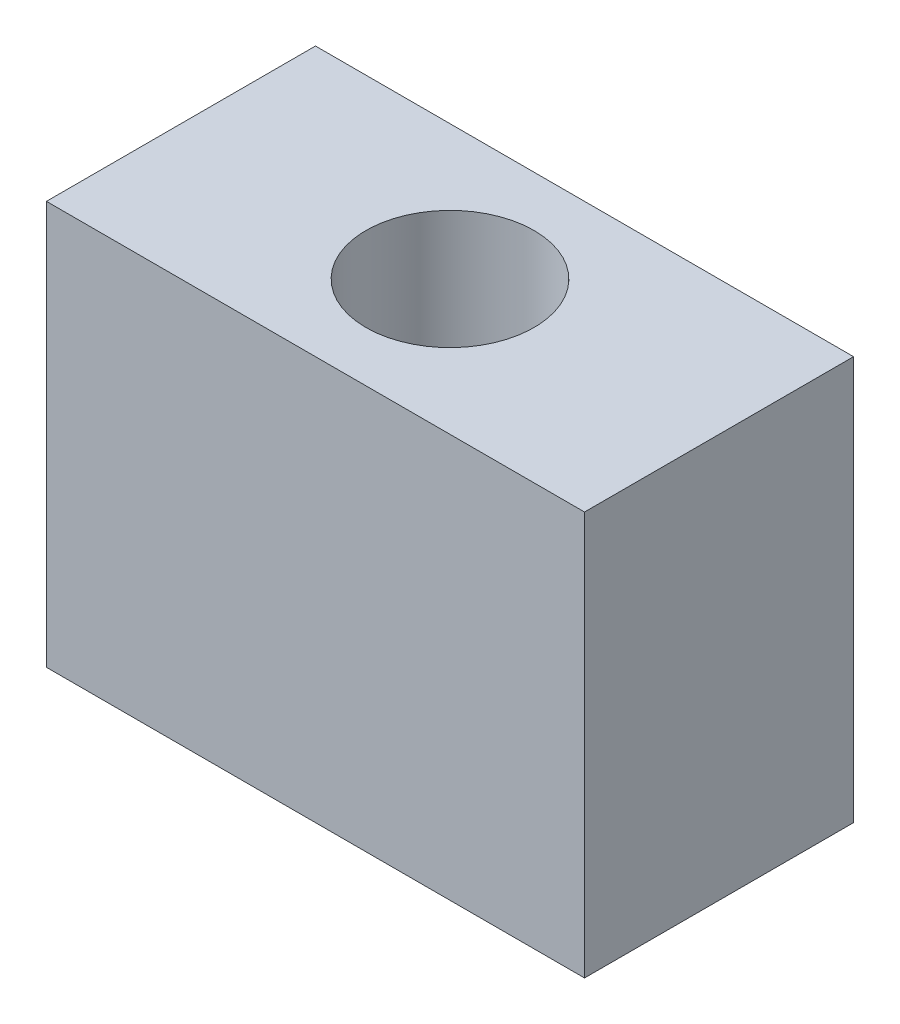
from build123d import *

# Parameters (mm, degrees)
SKETCH1_W   = 50.8
SKETCH1_H   = 25.4
SKETCH1_R   = 7.9375
BLOCK_DEPTH = 19.05
SKETCH1_3_R = 7.9375
HOLE_DEPTH  = 19.05


with BuildPart() as part:
    # Sketch1 → Block (new, symmetric)
    # profile 1 of 2: a face of its own
    with BuildSketch(Plane(origin=(0, 0, 0), x_dir=(1, 0, 0), z_dir=(0, 1, 0))):
        Rectangle(SKETCH1_W, SKETCH1_H)
        Circle(SKETCH1_R, mode=Mode.SUBTRACT)
    # profile 2 of 2: a face of its own
    with BuildSketch(Plane(origin=(0, 0, 0), x_dir=(1, 0, 0), z_dir=(0, 1, 0))):
        Circle(SKETCH1_R)
    extrude(amount=BLOCK_DEPTH, both=True)

    # Sketch1_3 → Hole (cut, symmetric)
    with BuildSketch(Plane(origin=(0, 0, 0), x_dir=(1, 0, 0), z_dir=(0, 1, 0))):
        with Locations(Location((0, 0, 0), (0, 0, 270))):
            Circle(SKETCH1_3_R)
    extrude(amount=HOLE_DEPTH, both=True, mode=Mode.SUBTRACT)


solid = part.part
